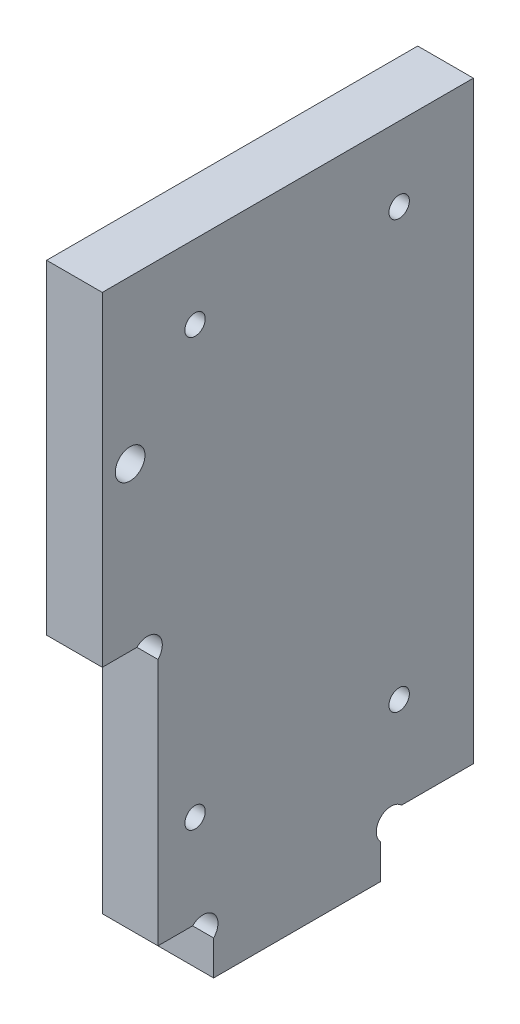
from build123d import *

# Parameters (mm, degrees)
ESQUISSE1_R        = 1.1
ESQUISSE1_R_2      = 1.6
BOSS_EXTRU_1_DEPTH = 6


with BuildPart() as part:
    # Esquisse1 → Boss.-Extru.1 (new body)
    with BuildSketch(Plane(origin=(0, 0, 0), x_dir=(0, 0, -1), z_dir=(1, 0, 0))):
        with BuildLine():
            Line((9, 3.7372583), (9, 0))
            Line((9, 0), (-9, 0))
            Line((-9, 0), (-9, 3.7372583))
            ThreePointArc((-9, 3.7372583), (-9, 6), (-11.2627417, 6))
            Line((-11.2627417, 6), (-15, 6))
            Line((-15, 6), (-15, 32.7372583))
            ThreePointArc((-15, 32.7372583), (-15, 35), (-17.2627417, 35))
            Line((-17.2627417, 35), (-21, 35))
            Line((-21, 35), (-21, 70))
            Line((-21, 70), (19, 70))
            Line((19, 70), (19, 6))
            Line((19, 6), (11.2627417, 6))
            ThreePointArc((11.2627417, 6), (9, 6), (9, 3.7372583))
        make_face()
        with Locations((11, 16)):
            Circle(ESQUISSE1_R, mode=Mode.SUBTRACT)
        with Locations((11, 62)):
            Circle(ESQUISSE1_R, mode=Mode.SUBTRACT)
        with Locations(Location((-11, 62, 0), (0, 0, 180))):
            Circle(ESQUISSE1_R, mode=Mode.SUBTRACT)
        with Locations(Location((-11, 16, 0), (0, 0, 180))):
            Circle(ESQUISSE1_R, mode=Mode.SUBTRACT)
        with Locations((-18, 52.5)):
            Circle(ESQUISSE1_R_2, mode=Mode.SUBTRACT)
    extrude(amount=BOSS_EXTRU_1_DEPTH)


solid = part.part
